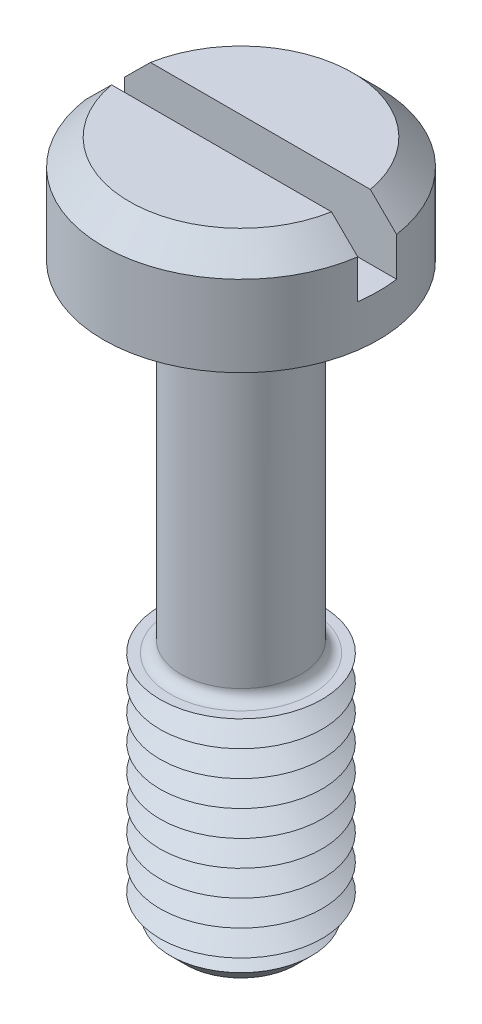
from build123d import *

# Parameters (mm, degrees)
SKETCH1_R           = 4.25
BOSS_EXTRUDE1_DEPTH = 3.3
SKETCH2_R           = 1.85
BOSS_EXTRUDE2_DEPTH = 18
SKETCH3_R           = 2.5
BOSS_EXTRUDE3_DEPTH = 7.5
CHAMFER1_SIZE       = 0.8
LPATTERN1_COUNT     = 9
LPATTERN1_PITCH     = 0.8
FILLET1_R           = 0.35
CHAMFER2_SIZE       = 0.8
SKETCH6_W           = 8.5
SKETCH6_H           = 1.2
CUT_EXTRUDE1_DEPTH  = 2


with BuildPart() as part:
    # Sketch1 → Boss-Extrude1 (new body)
    with BuildSketch(Plane(origin=(0, 0, 0), x_dir=(1, 0, 0), z_dir=(0, 1, 0))):
        with Locations(Location((0, 0, 0), (0, 0, 270))):
            Circle(SKETCH1_R)
    extrude(amount=BOSS_EXTRUDE1_DEPTH)

    # Sketch2 → Boss-Extrude2 (add)
    with BuildSketch(Plane.XZ):
        with Locations(Location((0, 0, 0), (0, 0, 270))):
            Circle(SKETCH2_R)
    extrude(amount=BOSS_EXTRUDE2_DEPTH)

    # Sketch3 → Boss-Extrude3 (add)
    with BuildSketch(Plane.XZ.offset(18)):
        with Locations(Location((0, 0, 0), (0, 0, 270))):
            Circle(SKETCH3_R)
    extrude(amount=-BOSS_EXTRUDE3_DEPTH)

    # Chamfer1
    chamfer1_edges = [part.edges().sort_by_distance(p)[0] for p in [
        (0, -18, 2.5),
    ]]
    chamfer(chamfer1_edges, length=CHAMFER1_SIZE)

    # Sketch5 → Cut-Revolve1 (revolve, cut)
    with BuildSketch(Plane(origin=(0, 0, 0), x_dir=(0, 0, -1), z_dir=(1, 0, 0))):
        Polygon((-2.5, -10.5), (-1.807179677, -10.9), (-2.5, -11.3), align=None)
    cut_revolve1 = revolve(axis=Axis((0, -6.58711856, 0), (0, -1, 0)), mode=Mode.SUBTRACT)

    # LPattern1: Cut-Revolve1 ×9
    with Locations(*[(0, -i * LPATTERN1_PITCH, 0) for i in range(1, LPATTERN1_COUNT)]):
        add(cut_revolve1, mode=Mode.SUBTRACT)

    # Fillet1
    fillet1_edges = [part.edges().sort_by_distance(p)[0] for p in [
        (0, 0, 1.85),
        (0, -10.5, 1.85),
    ]]
    fillet(fillet1_edges, radius=FILLET1_R)

    # Chamfer2
    chamfer2_edges = [part.edges().sort_by_distance(p)[0] for p in [
        (0, 3.3, -4.25),
    ]]
    chamfer(chamfer2_edges, length=CHAMFER2_SIZE)

    # Sketch6 → Cut-Extrude1 (cut)
    with BuildSketch(Plane(origin=(0, 3.3, 0), x_dir=(1, 0, 0), z_dir=(0, 1, 0))):
        Rectangle(SKETCH6_W, SKETCH6_H)
    extrude(amount=-CUT_EXTRUDE1_DEPTH, mode=Mode.SUBTRACT)


solid = part.part
